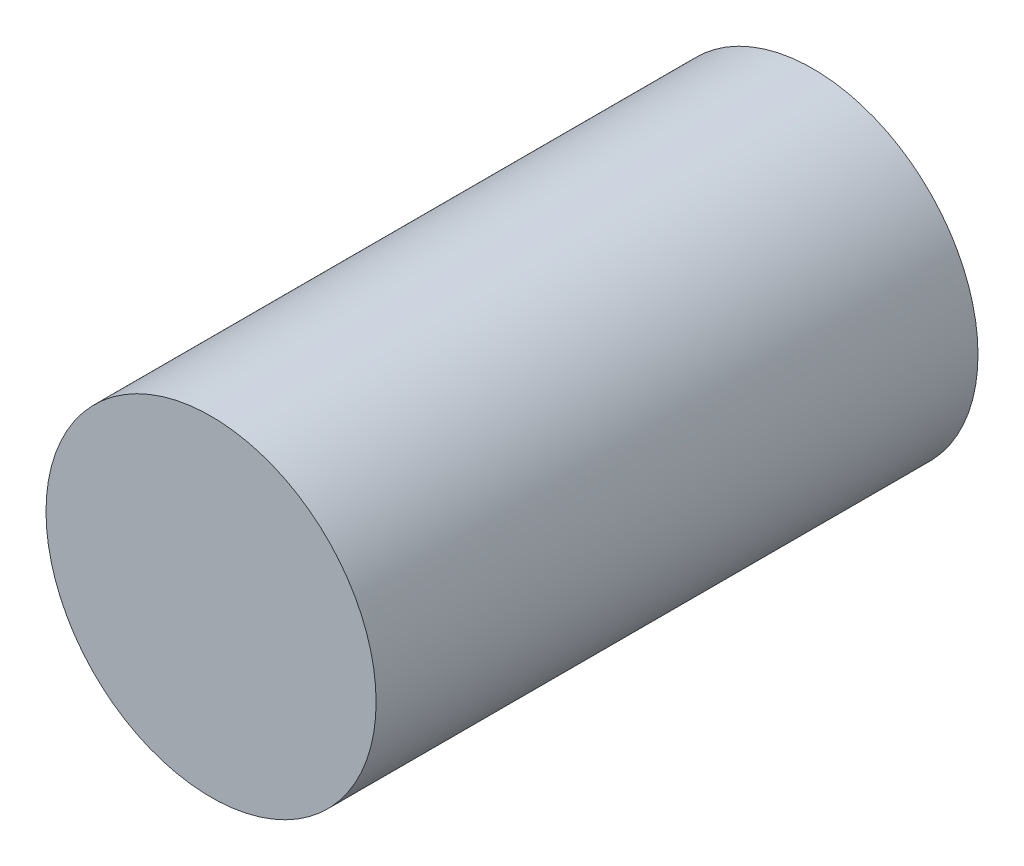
from build123d import *

# Parameters (mm, degrees)
ESQUISSE1_R        = 16.178674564
BOSS_EXTRU_1_DEPTH = 59


with BuildPart() as part:
    # Esquisse1 → Boss.-Extru.1 (new body)
    with BuildSketch(Plane.XY):
        Circle(ESQUISSE1_R)
    extrude(amount=-BOSS_EXTRU_1_DEPTH)


solid = part.part
